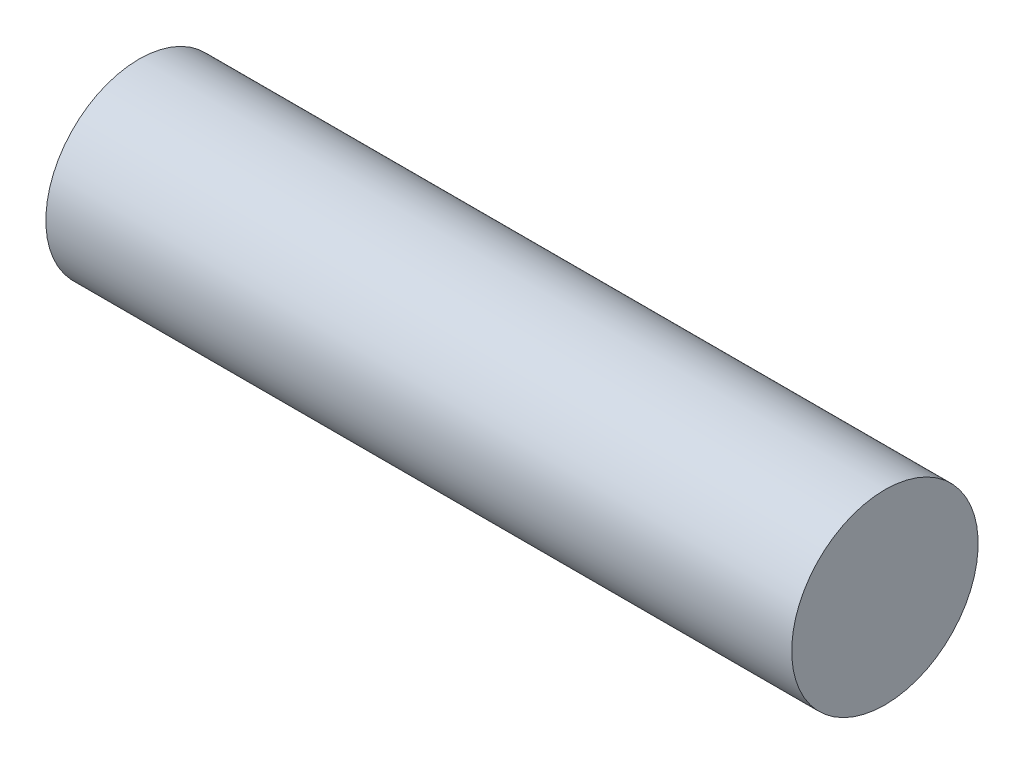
ISO-10303-21;
HEADER;
FILE_DESCRIPTION(('STEP AP214'),'2;1');
FILE_NAME('part.step','',(''),(''),'','','');
FILE_SCHEMA(('AUTOMOTIVE_DESIGN { 1 0 10303 214 1 1 1 1 }'));
ENDSEC;
DATA;
#1=APPLICATION_CONTEXT('core data for automotive mechanical design processes');
#2=APPLICATION_PROTOCOL_DEFINITION('international standard','automotive_design',2000,#1);
#3=PRODUCT_CONTEXT('',#1,'mechanical');
#4=PRODUCT('Part','Part','',(#3));
#5=PRODUCT_RELATED_PRODUCT_CATEGORY('part','',(#4));
#6=PRODUCT_DEFINITION_FORMATION('','',#4);
#7=PRODUCT_DEFINITION_CONTEXT('part definition',#1,'design');
#8=PRODUCT_DEFINITION('design','',#6,#7);
#9=PRODUCT_DEFINITION_SHAPE('','',#8);
#10=(LENGTH_UNIT() NAMED_UNIT(*) SI_UNIT(.MILLI.,.METRE.));
#11=(NAMED_UNIT(*) PLANE_ANGLE_UNIT() SI_UNIT($,.RADIAN.));
#12=(NAMED_UNIT(*) SI_UNIT($,.STERADIAN.) SOLID_ANGLE_UNIT());
#13=UNCERTAINTY_MEASURE_WITH_UNIT(LENGTH_MEASURE(1.E-05),#10,'distance_accuracy_value','');
#14=(GEOMETRIC_REPRESENTATION_CONTEXT(3) GLOBAL_UNCERTAINTY_ASSIGNED_CONTEXT((#13)) GLOBAL_UNIT_ASSIGNED_CONTEXT((#10,
#11,#12)) REPRESENTATION_CONTEXT('',''));
#15=CARTESIAN_POINT('',(0.,0.,0.));
#16=DIRECTION('',(0.,0.,1.));
#17=DIRECTION('',(1.,0.,0.));
#18=AXIS2_PLACEMENT_3D('',#15,#16,#17);
#19=CARTESIAN_POINT('',(-19.9,129.35,0.));
#20=DIRECTION('',(1.,0.,0.));
#21=DIRECTION('',(0.,1.,0.));
#22=AXIS2_PLACEMENT_3D('',#19,#20,#21);
#23=CYLINDRICAL_SURFACE('',#22,2.4875);
#24=CARTESIAN_POINT('',(-19.9,129.35,0.));
#25=DIRECTION('',(-1.,0.,0.));
#26=DIRECTION('',(0.,-1.,0.));
#27=AXIS2_PLACEMENT_3D('',#24,#25,#26);
#28=CIRCLE('',#27,2.4875);
#29=CARTESIAN_POINT('',(-19.9,126.8625,0.));
#30=VERTEX_POINT('',#29);
#31=EDGE_CURVE('E10',#30,#30,#28,.T.);
#32=ORIENTED_EDGE('',*,*,#31,.F.);
#33=EDGE_LOOP('',(#32));
#34=FACE_BOUND('',#33,.T.);
#35=CARTESIAN_POINT('',(0.,129.35,0.));
#36=DIRECTION('',(-1.,0.,0.));
#37=DIRECTION('',(0.,-1.,0.));
#38=AXIS2_PLACEMENT_3D('',#35,#36,#37);
#39=CIRCLE('',#38,2.4875);
#40=CARTESIAN_POINT('',(0.,126.8625,0.));
#41=VERTEX_POINT('',#40);
#42=EDGE_CURVE('E21',#41,#41,#39,.T.);
#43=ORIENTED_EDGE('',*,*,#42,.T.);
#44=EDGE_LOOP('',(#43));
#45=FACE_BOUND('',#44,.T.);
#46=ADVANCED_FACE('F14',(#34,#45),#23,.T.);
#47=CARTESIAN_POINT('',(-19.9,129.35,0.));
#48=DIRECTION('',(-1.,0.,0.));
#49=DIRECTION('',(0.,-1.,0.));
#50=AXIS2_PLACEMENT_3D('',#47,#48,#49);
#51=PLANE('',#50);
#52=ORIENTED_EDGE('',*,*,#31,.T.);
#53=EDGE_LOOP('',(#52));
#54=FACE_BOUND('',#53,.T.);
#55=ADVANCED_FACE('F49',(#54),#51,.T.);
#56=CARTESIAN_POINT('',(0.,129.35,0.));
#57=DIRECTION('',(-1.,0.,0.));
#58=DIRECTION('',(0.,-1.,0.));
#59=AXIS2_PLACEMENT_3D('',#56,#57,#58);
#60=PLANE('',#59);
#61=ORIENTED_EDGE('',*,*,#42,.F.);
#62=EDGE_LOOP('',(#61));
#63=FACE_BOUND('',#62,.T.);
#64=ADVANCED_FACE('F47',(#63),#60,.F.);
#65=CLOSED_SHELL('',(#46,#55,#64));
#66=MANIFOLD_SOLID_BREP('B1',#65);
#67=ADVANCED_BREP_SHAPE_REPRESENTATION('',(#18,#66),#14);
#68=SHAPE_DEFINITION_REPRESENTATION(#9,#67);
ENDSEC;
END-ISO-10303-21;
